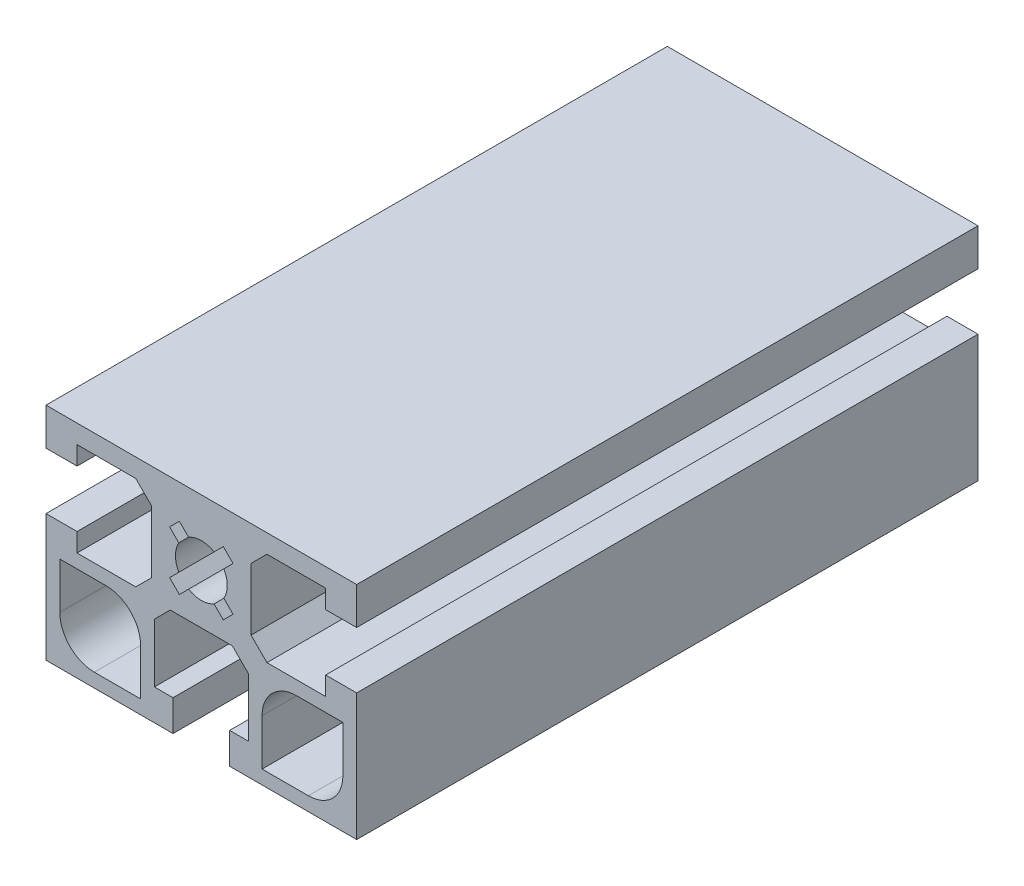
from build123d import *

# Parameters (mm, degrees)
EXTRUDE1_DEPTH      = 45
EXTRUDE1_DEPTH_BACK = 45


with BuildPart() as part:
    # Sketch1 → Extrude1 (new, two sides: drawn at the far end of the back side and taken through both)
    with BuildSketch(Plane.XY.offset(-EXTRUDE1_DEPTH_BACK)):
        Polygon((-22.499999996, -22.499999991), (-4.099999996, -22.499999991), (-4.099999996, -17.999999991), (-6.799999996, -17.999999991), (-6.799999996, -9.499999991), (-4.499999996, -7.199999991), (4.500000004, -7.199999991), (6.800000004, -9.499999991), (6.800000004, -17.999999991), (4.100000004, -17.999999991), (4.100000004, -22.499999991), (22.499999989, -22.499999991), (22.499999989, -4.099999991), (17.999999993, -4.099999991), (17.999999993, -6.799999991), (9.499999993, -6.799999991), (7.199999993, -4.499999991), (7.199999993, 4.500000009), (9.499999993, 6.800000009), (17.999999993, 6.800000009), (17.999999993, 4.100000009), (22.499999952, 4.100000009), (22.499999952, 9.499999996), (-22.499999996, 9.499999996), (-22.499999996, 4.100000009), (-17.999999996, 4.100000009), (-17.999999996, 6.800000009), (-9.499999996, 6.800000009), (-7.199999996, 4.500000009), (-7.199999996, -4.499999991), (-9.499999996, -6.799999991), (-17.999999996, -6.799999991), (-17.999999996, -4.099999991), (-22.499999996, -4.099999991), align=None)
        with BuildLine():
            Line((-20.499997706, -15.500002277), (-20.499997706, -8.799997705))
            Line((-20.499997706, -8.799997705), (-13.799993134, -8.799997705))
            ThreePointArc((-13.799993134, -8.799997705), (-10.264459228, -10.264463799), (-8.799993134, -13.799997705))
            Line((-8.799993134, -13.799997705), (-8.799993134, -20.500002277))
            Line((-8.799993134, -20.500002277), (-15.499997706, -20.500002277))
            ThreePointArc((-15.499997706, -20.500002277), (-19.035531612, -19.035536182), (-20.499997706, -15.500002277))
        make_face(mode=Mode.SUBTRACT)
        with BuildLine():
            Line((8.799993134, -20.500002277), (8.799993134, -13.799997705))
            ThreePointArc((8.799993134, -13.799997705), (10.264459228, -10.264463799), (13.799993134, -8.799997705))
            Line((13.799993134, -8.799997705), (20.499997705, -8.799997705))
            Line((20.499997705, -8.799997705), (20.499997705, -15.500002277))
            ThreePointArc((20.499997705, -15.500002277), (19.035531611, -19.035536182), (15.499997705, -20.500002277))
            Line((15.499997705, -20.500002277), (8.799993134, -20.500002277))
        make_face(mode=Mode.SUBTRACT)
        with BuildLine():
            Line((-3.262737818, 1.848524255), (-4.596194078, 3.181980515))
            Line((-4.596194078, 3.181980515), (-3.181980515, 4.596194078))
            Line((-3.181980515, 4.596194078), (-1.848524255, 3.262737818))
            ThreePointArc((-1.848524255, 3.262737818), (0, 3.749999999), (1.848524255, 3.262737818))
            Line((1.848524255, 3.262737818), (3.181980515, 4.596194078))
            Line((3.181980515, 4.596194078), (4.596194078, 3.181980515))
            Line((4.596194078, 3.181980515), (3.262737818, 1.848524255))
            ThreePointArc((3.262737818, 1.848524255), (3.749999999, 0), (3.262737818, -1.848524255))
            Line((3.262737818, -1.848524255), (4.596194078, -3.181980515))
            Line((4.596194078, -3.181980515), (3.181980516, -4.596194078))
            Line((3.181980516, -4.596194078), (1.848524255, -3.262737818))
            ThreePointArc((1.848524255, -3.262737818), (0, -3.749999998), (-1.848524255, -3.262737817))
            Line((-1.848524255, -3.262737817), (-3.181980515, -4.596194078))
            Line((-3.181980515, -4.596194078), (-4.596194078, -3.181980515))
            Line((-4.596194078, -3.181980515), (-3.262737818, -1.848524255))
            ThreePointArc((-3.262737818, -1.848524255), (-3.749999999, 0), (-3.262737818, 1.848524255))
        make_face(mode=Mode.SUBTRACT)
    extrude(amount=EXTRUDE1_DEPTH + EXTRUDE1_DEPTH_BACK)


solid = part.part
